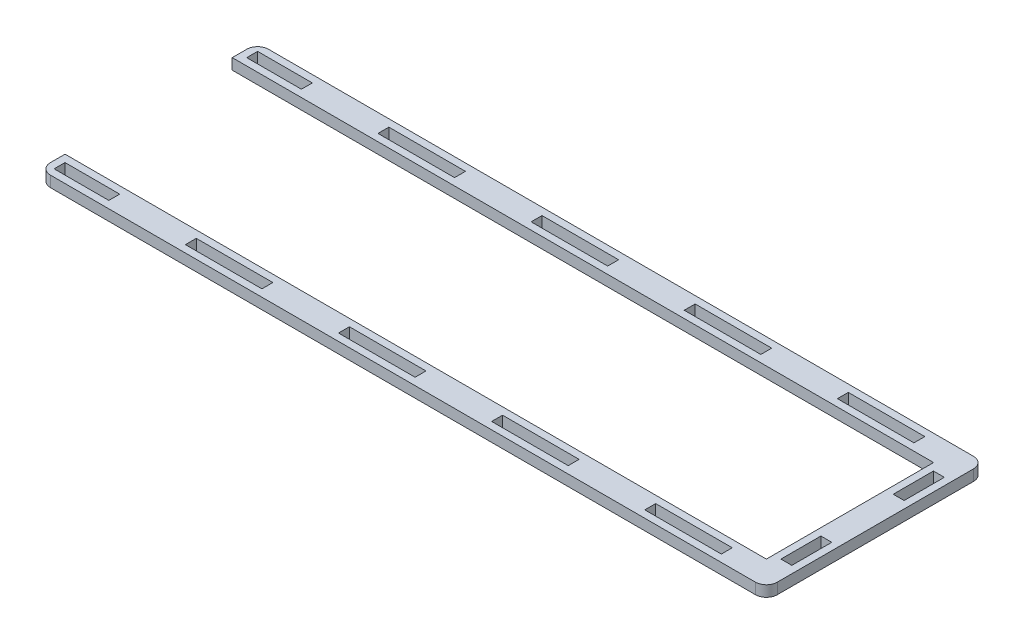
from build123d import *

# Parameters (mm, degrees)
SKETCH_1_W      = 15.049999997
SKETCH_1_H      = 3
SKETCH_1_W_2    = 21.07
SKETCH_1_W_3    = 21.0697
SKETCH_1_W_4    = 21.069600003
SKETCH_1_W_5    = 3
SKETCH_1_H_2    = 11.064753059
SKETCH_1_H_3    = 11
SKETCH_1_W_6    = 15.0499
EXTRUDE_1_DEPTH = 3


with BuildPart() as part:
    # Sketch 1 → Extrude 1 (new body)
    with BuildSketch(Plane(origin=(0, 0, 0), x_dir=(1, 0, 0), z_dir=(0, 1, 0))):
        with BuildLine():
            Line((0, -6.98430899), (193, -6.98430899))
            Line((193, -6.98430899), (193, -53))
            Line((193, -53), (0, -53))
            Line((0, -53), (0, -57))
            ThreePointArc((0, -57), (0.878679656, -59.121320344), (3, -60))
            Line((3, -60), (197, -60))
            ThreePointArc((197, -60), (199.121320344, -59.121320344), (200, -57))
            Line((200, -57), (200, -3))
            ThreePointArc((200, -3), (199.121320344, -0.878679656), (197, 0))
            Line((197, 0), (3, 0))
            ThreePointArc((3, 0), (0.878679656, -0.878679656), (0, -3))
            Line((0, -3), (0, -6.98430899))
        make_face()
        with Locations((9.524999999, -3.5)):
            Rectangle(SKETCH_1_W, SKETCH_1_H, mode=Mode.SUBTRACT)
        with Locations((48.654799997, -3.5)):
            Rectangle(SKETCH_1_W_2, SKETCH_1_H, mode=Mode.SUBTRACT)
        with Locations((90.794549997, -3.5)):
            Rectangle(SKETCH_1_W_3, SKETCH_1_H, mode=Mode.SUBTRACT)
        with Locations((132.934349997, -3.5)):
            Rectangle(SKETCH_1_W_3, SKETCH_1_H, mode=Mode.SUBTRACT)
        with Locations((175.073999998, -3.5)):
            Rectangle(SKETCH_1_W_4, SKETCH_1_H, mode=Mode.SUBTRACT)
        with Locations((196.5, -14.557344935)):
            Rectangle(SKETCH_1_W_5, SKETCH_1_H_2, mode=Mode.SUBTRACT)
        with Locations((196.5, -45.5)):
            Rectangle(SKETCH_1_W_5, SKETCH_1_H_3, mode=Mode.SUBTRACT)
        with Locations((175.07395, -56.5)):
            Rectangle(SKETCH_1_W_3, SKETCH_1_H, mode=Mode.SUBTRACT)
        with Locations((132.93425, -56.5)):
            Rectangle(SKETCH_1_W_3, SKETCH_1_H, mode=Mode.SUBTRACT)
        with Locations((90.79445, -56.5)):
            Rectangle(SKETCH_1_W_3, SKETCH_1_H, mode=Mode.SUBTRACT)
        with Locations((48.6547, -56.5)):
            Rectangle(SKETCH_1_W_2, SKETCH_1_H, mode=Mode.SUBTRACT)
        with Locations((9.52495, -56.5)):
            Rectangle(SKETCH_1_W_6, SKETCH_1_H, mode=Mode.SUBTRACT)
    extrude(amount=EXTRUDE_1_DEPTH)


solid = part.part
